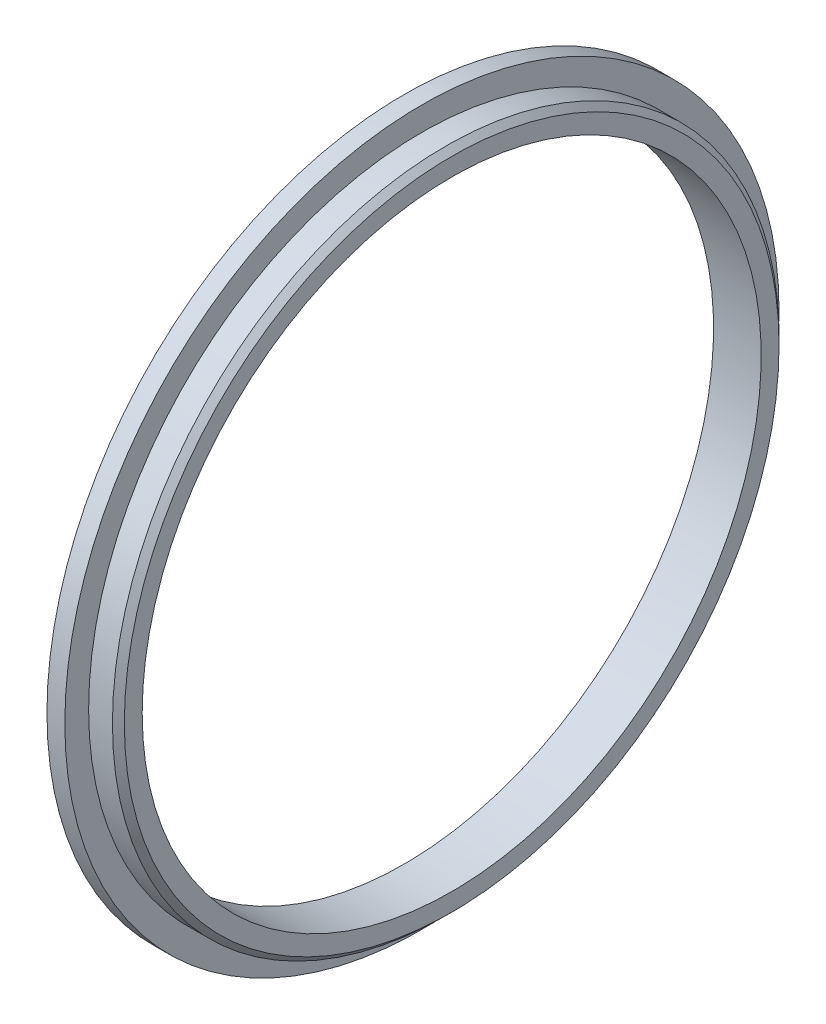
from build123d import *


with BuildPart() as part:
    # Esquisse1 → R_volution1 (revolve)
    with BuildSketch(Plane.XY, mode=Mode.PRIVATE) as r_volution1_sk:
        Polygon((0, 26), (0, 30), (1.5, 30), (1.5, 28), (3.5, 28), (4, 27.5), (4, 26), align=None)
    revolve(r_volution1_sk.sketch.rotate(Axis((-1.23336929, 0, 0), (1, 0, 0)), 90), axis=Axis((-1.23336929, 0, 0), (1, 0, 0)))


solid = part.part
